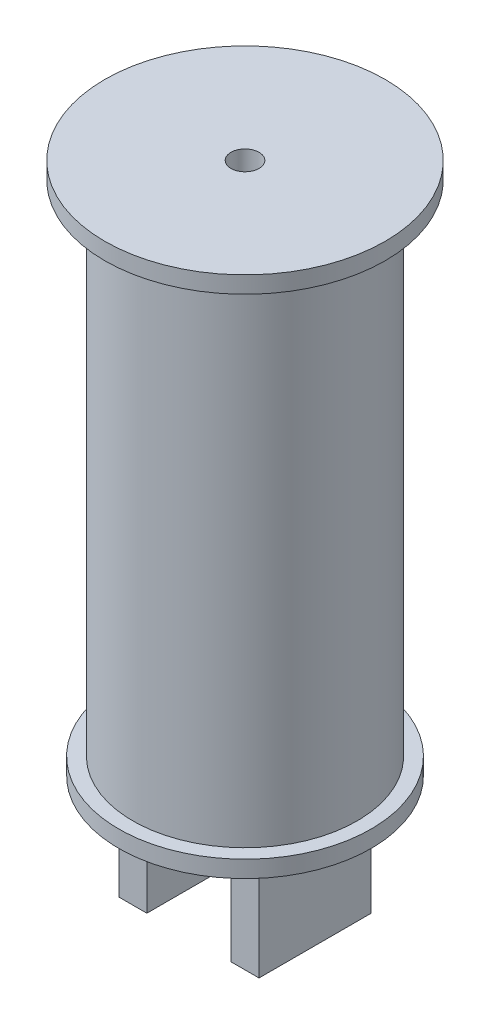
ISO-10303-21;
HEADER;
FILE_DESCRIPTION(('STEP AP214'),'2;1');
FILE_NAME('part.step','',(''),(''),'','','');
FILE_SCHEMA(('AUTOMOTIVE_DESIGN { 1 0 10303 214 1 1 1 1 }'));
ENDSEC;
DATA;
#1=APPLICATION_CONTEXT('core data for automotive mechanical design processes');
#2=APPLICATION_PROTOCOL_DEFINITION('international standard','automotive_design',2000,#1);
#3=PRODUCT_CONTEXT('',#1,'mechanical');
#4=PRODUCT('Part','Part','',(#3));
#5=PRODUCT_RELATED_PRODUCT_CATEGORY('part','',(#4));
#6=PRODUCT_DEFINITION_FORMATION('','',#4);
#7=PRODUCT_DEFINITION_CONTEXT('part definition',#1,'design');
#8=PRODUCT_DEFINITION('design','',#6,#7);
#9=PRODUCT_DEFINITION_SHAPE('','',#8);
#10=(LENGTH_UNIT() NAMED_UNIT(*) SI_UNIT(.MILLI.,.METRE.));
#11=(NAMED_UNIT(*) PLANE_ANGLE_UNIT() SI_UNIT($,.RADIAN.));
#12=(NAMED_UNIT(*) SI_UNIT($,.STERADIAN.) SOLID_ANGLE_UNIT());
#13=UNCERTAINTY_MEASURE_WITH_UNIT(LENGTH_MEASURE(1.E-05),#10,'distance_accuracy_value','');
#14=(GEOMETRIC_REPRESENTATION_CONTEXT(3) GLOBAL_UNCERTAINTY_ASSIGNED_CONTEXT((#13)) GLOBAL_UNIT_ASSIGNED_CONTEXT((#10,
#11,#12)) REPRESENTATION_CONTEXT('',''));
#15=CARTESIAN_POINT('',(0.,0.,0.));
#16=DIRECTION('',(0.,0.,1.));
#17=DIRECTION('',(1.,0.,0.));
#18=AXIS2_PLACEMENT_3D('',#15,#16,#17);
#19=CARTESIAN_POINT('',(-715.861525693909,536.876132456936,0.));
#20=DIRECTION('',(0.,1.,0.));
#21=DIRECTION('',(0.,0.,1.));
#22=AXIS2_PLACEMENT_3D('',#19,#20,#21);
#23=PLANE('',#22);
#24=CARTESIAN_POINT('',(-865.86152569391,536.876132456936,0.));
#25=DIRECTION('',(0.,-1.,0.));
#26=DIRECTION('',(0.,0.,-1.));
#27=AXIS2_PLACEMENT_3D('',#24,#25,#26);
#28=CIRCLE('',#27,300.);
#29=CARTESIAN_POINT('',(-865.86152569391,536.876132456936,-300.));
#30=VERTEX_POINT('',#29);
#31=EDGE_CURVE('E19',#30,#30,#28,.T.);
#32=ORIENTED_EDGE('',*,*,#31,.F.);
#33=EDGE_LOOP('',(#32));
#34=FACE_BOUND('',#33,.T.);
#35=ADVANCED_FACE('F16',(#34),#23,.T.);
#36=CARTESIAN_POINT('',(-865.86152569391,1886.87613245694,0.));
#37=DIRECTION('',(0.,-1.,0.));
#38=DIRECTION('',(0.,0.,-1.));
#39=AXIS2_PLACEMENT_3D('',#36,#37,#38);
#40=CYLINDRICAL_SURFACE('',#39,300.);
#41=CARTESIAN_POINT('',(-865.86152569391,1886.87613245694,0.));
#42=DIRECTION('',(0.,-1.,0.));
#43=DIRECTION('',(0.,0.,-1.));
#44=AXIS2_PLACEMENT_3D('',#41,#42,#43);
#45=CIRCLE('',#44,300.);
#46=CARTESIAN_POINT('',(-865.86152569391,1886.87613245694,-300.));
#47=VERTEX_POINT('',#46);
#48=EDGE_CURVE('E97',#47,#47,#45,.T.);
#49=ORIENTED_EDGE('',*,*,#48,.F.);
#50=EDGE_LOOP('',(#49));
#51=FACE_BOUND('',#50,.T.);
#52=ORIENTED_EDGE('',*,*,#31,.T.);
#53=EDGE_LOOP('',(#52));
#54=FACE_BOUND('',#53,.T.);
#55=ADVANCED_FACE('F135',(#51,#54),#40,.F.);
#56=CARTESIAN_POINT('',(-1065.86152569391,-213.123867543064,0.));
#57=DIRECTION('',(0.,1.,0.));
#58=DIRECTION('',(0.,0.,1.));
#59=AXIS2_PLACEMENT_3D('',#56,#57,#58);
#60=PLANE('',#59);
#61=DIRECTION('',(1.,0.,0.));
#62=VECTOR('',#61,1.);
#63=CARTESIAN_POINT('',(-1115.86152569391,-213.123867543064,200.));
#64=LINE('',#63,#62);
#65=CARTESIAN_POINT('',(-1115.86152569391,-213.123867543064,200.));
#66=VERTEX_POINT('',#65);
#67=CARTESIAN_POINT('',(-1015.86152569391,-213.123867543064,200.));
#68=VERTEX_POINT('',#67);
#69=EDGE_CURVE('E330',#66,#68,#64,.T.);
#70=ORIENTED_EDGE('',*,*,#69,.F.);
#71=DIRECTION('',(0.,0.,1.));
#72=VECTOR('',#71,1.);
#73=CARTESIAN_POINT('',(-1115.86152569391,-213.123867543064,-200.));
#74=LINE('',#73,#72);
#75=CARTESIAN_POINT('',(-1115.86152569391,-213.123867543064,-200.));
#76=VERTEX_POINT('',#75);
#77=EDGE_CURVE('E79',#76,#66,#74,.T.);
#78=ORIENTED_EDGE('',*,*,#77,.F.);
#79=DIRECTION('',(-1.,0.,0.));
#80=VECTOR('',#79,1.);
#81=CARTESIAN_POINT('',(-1015.86152569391,-213.123867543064,-200.));
#82=LINE('',#81,#80);
#83=CARTESIAN_POINT('',(-1015.86152569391,-213.123867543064,-200.));
#84=VERTEX_POINT('',#83);
#85=EDGE_CURVE('E81',#84,#76,#82,.T.);
#86=ORIENTED_EDGE('',*,*,#85,.F.);
#87=DIRECTION('',(0.,0.,1.));
#88=VECTOR('',#87,1.);
#89=CARTESIAN_POINT('',(-1015.86152569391,-213.123867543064,200.));
#90=LINE('',#89,#88);
#91=EDGE_CURVE('E84',#68,#84,#90,.F.);
#92=ORIENTED_EDGE('',*,*,#91,.F.);
#93=EDGE_LOOP('',(#70,#78,#86,#92));
#94=FACE_BOUND('',#93,.T.);
#95=ADVANCED_FACE('F83',(#94),#60,.F.);
#96=CARTESIAN_POINT('',(-665.861525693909,-213.123867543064,0.));
#97=DIRECTION('',(0.,1.,0.));
#98=DIRECTION('',(0.,0.,1.));
#99=AXIS2_PLACEMENT_3D('',#96,#97,#98);
#100=PLANE('',#99);
#101=DIRECTION('',(1.,0.,0.));
#102=VECTOR('',#101,1.);
#103=CARTESIAN_POINT('',(-715.86152569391,-213.123867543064,200.));
#104=LINE('',#103,#102);
#105=CARTESIAN_POINT('',(-715.86152569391,-213.123867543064,200.));
#106=VERTEX_POINT('',#105);
#107=CARTESIAN_POINT('',(-615.86152569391,-213.123867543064,200.));
#108=VERTEX_POINT('',#107);
#109=EDGE_CURVE('E300',#106,#108,#104,.T.);
#110=ORIENTED_EDGE('',*,*,#109,.F.);
#111=DIRECTION('',(0.,0.,1.));
#112=VECTOR('',#111,1.);
#113=CARTESIAN_POINT('',(-715.861525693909,-213.123867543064,-200.));
#114=LINE('',#113,#112);
#115=CARTESIAN_POINT('',(-715.861525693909,-213.123867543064,-200.));
#116=VERTEX_POINT('',#115);
#117=EDGE_CURVE('E301',#116,#106,#114,.T.);
#118=ORIENTED_EDGE('',*,*,#117,.F.);
#119=DIRECTION('',(-1.,0.,0.));
#120=VECTOR('',#119,1.);
#121=CARTESIAN_POINT('',(-615.86152569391,-213.123867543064,-200.));
#122=LINE('',#121,#120);
#123=CARTESIAN_POINT('',(-615.86152569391,-213.123867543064,-200.));
#124=VERTEX_POINT('',#123);
#125=EDGE_CURVE('E323',#124,#116,#122,.T.);
#126=ORIENTED_EDGE('',*,*,#125,.F.);
#127=DIRECTION('',(0.,0.,-1.));
#128=VECTOR('',#127,1.);
#129=CARTESIAN_POINT('',(-615.86152569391,-213.123867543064,200.));
#130=LINE('',#129,#128);
#131=EDGE_CURVE('E304',#108,#124,#130,.T.);
#132=ORIENTED_EDGE('',*,*,#131,.F.);
#133=EDGE_LOOP('',(#110,#118,#126,#132));
#134=FACE_BOUND('',#133,.T.);
#135=ADVANCED_FACE('F209',(#134),#100,.F.);
#136=CARTESIAN_POINT('',(-690.86152569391,1886.87613245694,0.));
#137=DIRECTION('',(0.,-1.,0.));
#138=DIRECTION('',(0.,0.,-1.));
#139=AXIS2_PLACEMENT_3D('',#136,#137,#138);
#140=PLANE('',#139);
#141=ORIENTED_EDGE('',*,*,#48,.T.);
#142=EDGE_LOOP('',(#141));
#143=FACE_BOUND('',#142,.T.);
#144=CARTESIAN_POINT('',(-865.86152569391,1886.87613245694,0.));
#145=DIRECTION('',(0.,-1.,0.));
#146=DIRECTION('',(0.,0.,-1.));
#147=AXIS2_PLACEMENT_3D('',#144,#145,#146);
#148=CIRCLE('',#147,50.0000000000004);
#149=CARTESIAN_POINT('',(-865.86152569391,1886.87613245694,-50.0000000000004));
#150=VERTEX_POINT('',#149);
#151=EDGE_CURVE('E126',#150,#150,#148,.T.);
#152=ORIENTED_EDGE('',*,*,#151,.F.);
#153=EDGE_LOOP('',(#152));
#154=FACE_BOUND('',#153,.T.);
#155=ADVANCED_FACE('F206',(#143,#154),#140,.T.);
#156=CARTESIAN_POINT('',(-1015.86152569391,186.876132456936,200.));
#157=DIRECTION('',(1.,0.,0.));
#158=DIRECTION('',(0.,1.,0.));
#159=AXIS2_PLACEMENT_3D('',#156,#157,#158);
#160=PLANE('',#159);
#161=DIRECTION('',(0.,0.,-1.));
#162=VECTOR('',#161,1.);
#163=CARTESIAN_POINT('',(-1015.86152569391,186.876132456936,0.));
#164=LINE('',#163,#162);
#165=CARTESIAN_POINT('',(-1015.86152569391,186.876132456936,200.));
#166=VERTEX_POINT('',#165);
#167=CARTESIAN_POINT('',(-1015.86152569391,186.876132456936,-200.));
#168=VERTEX_POINT('',#167);
#169=EDGE_CURVE('E128',#166,#168,#164,.T.);
#170=ORIENTED_EDGE('',*,*,#169,.F.);
#171=DIRECTION('',(0.,1.,0.));
#172=VECTOR('',#171,1.);
#173=CARTESIAN_POINT('',(-1015.86152569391,186.876132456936,200.));
#174=LINE('',#173,#172);
#175=EDGE_CURVE('E95',#68,#166,#174,.T.);
#176=ORIENTED_EDGE('',*,*,#175,.F.);
#177=ORIENTED_EDGE('',*,*,#91,.T.);
#178=DIRECTION('',(0.,1.,0.));
#179=VECTOR('',#178,1.);
#180=CARTESIAN_POINT('',(-1015.86152569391,186.876132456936,-200.));
#181=LINE('',#180,#179);
#182=EDGE_CURVE('E89',#168,#84,#181,.F.);
#183=ORIENTED_EDGE('',*,*,#182,.F.);
#184=EDGE_LOOP('',(#170,#176,#177,#183));
#185=FACE_BOUND('',#184,.T.);
#186=ADVANCED_FACE('F92',(#185),#160,.T.);
#187=CARTESIAN_POINT('',(-1015.86152569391,186.876132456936,-200.));
#188=DIRECTION('',(0.,0.,-1.));
#189=DIRECTION('',(-1.,0.,0.));
#190=AXIS2_PLACEMENT_3D('',#187,#188,#189);
#191=PLANE('',#190);
#192=DIRECTION('',(1.,0.,0.));
#193=VECTOR('',#192,1.);
#194=CARTESIAN_POINT('',(-640.86152569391,186.876132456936,-200.));
#195=LINE('',#194,#193);
#196=CARTESIAN_POINT('',(-1115.86152569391,186.876132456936,-200.));
#197=VERTEX_POINT('',#196);
#198=EDGE_CURVE('E101',#168,#197,#195,.F.);
#199=ORIENTED_EDGE('',*,*,#198,.F.);
#200=ORIENTED_EDGE('',*,*,#182,.T.);
#201=ORIENTED_EDGE('',*,*,#85,.T.);
#202=DIRECTION('',(0.,1.,0.));
#203=VECTOR('',#202,1.);
#204=CARTESIAN_POINT('',(-1115.86152569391,186.876132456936,-200.));
#205=LINE('',#204,#203);
#206=EDGE_CURVE('E104',#197,#76,#205,.F.);
#207=ORIENTED_EDGE('',*,*,#206,.F.);
#208=EDGE_LOOP('',(#199,#200,#201,#207));
#209=FACE_BOUND('',#208,.T.);
#210=ADVANCED_FACE('F99',(#209),#191,.T.);
#211=CARTESIAN_POINT('',(-1115.86152569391,186.876132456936,-200.));
#212=DIRECTION('',(-1.,0.,0.));
#213=DIRECTION('',(0.,0.,1.));
#214=AXIS2_PLACEMENT_3D('',#211,#212,#213);
#215=PLANE('',#214);
#216=DIRECTION('',(0.,0.,-1.));
#217=VECTOR('',#216,1.);
#218=CARTESIAN_POINT('',(-1115.86152569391,186.876132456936,0.));
#219=LINE('',#218,#217);
#220=CARTESIAN_POINT('',(-1115.86152569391,186.876132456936,200.));
#221=VERTEX_POINT('',#220);
#222=EDGE_CURVE('E333',#197,#221,#219,.F.);
#223=ORIENTED_EDGE('',*,*,#222,.F.);
#224=ORIENTED_EDGE('',*,*,#206,.T.);
#225=ORIENTED_EDGE('',*,*,#77,.T.);
#226=DIRECTION('',(0.,1.,0.));
#227=VECTOR('',#226,1.);
#228=CARTESIAN_POINT('',(-1115.86152569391,186.876132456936,200.));
#229=LINE('',#228,#227);
#230=EDGE_CURVE('E326',#221,#66,#229,.F.);
#231=ORIENTED_EDGE('',*,*,#230,.F.);
#232=EDGE_LOOP('',(#223,#224,#225,#231));
#233=FACE_BOUND('',#232,.T.);
#234=ADVANCED_FACE('F197',(#233),#215,.T.);
#235=CARTESIAN_POINT('',(-1115.86152569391,186.876132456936,200.));
#236=DIRECTION('',(0.,0.,1.));
#237=DIRECTION('',(1.,0.,0.));
#238=AXIS2_PLACEMENT_3D('',#235,#236,#237);
#239=PLANE('',#238);
#240=DIRECTION('',(1.,0.,0.));
#241=VECTOR('',#240,1.);
#242=CARTESIAN_POINT('',(-640.86152569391,186.876132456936,200.));
#243=LINE('',#242,#241);
#244=EDGE_CURVE('E337',#221,#166,#243,.T.);
#245=ORIENTED_EDGE('',*,*,#244,.F.);
#246=ORIENTED_EDGE('',*,*,#230,.T.);
#247=ORIENTED_EDGE('',*,*,#69,.T.);
#248=ORIENTED_EDGE('',*,*,#175,.T.);
#249=EDGE_LOOP('',(#245,#246,#247,#248));
#250=FACE_BOUND('',#249,.T.);
#251=ADVANCED_FACE('F193',(#250),#239,.T.);
#252=CARTESIAN_POINT('',(-615.86152569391,186.876132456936,200.));
#253=DIRECTION('',(1.,0.,0.));
#254=DIRECTION('',(0.,0.,-1.));
#255=AXIS2_PLACEMENT_3D('',#252,#253,#254);
#256=PLANE('',#255);
#257=DIRECTION('',(0.,0.,-1.));
#258=VECTOR('',#257,1.);
#259=CARTESIAN_POINT('',(-615.86152569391,186.876132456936,0.));
#260=LINE('',#259,#258);
#261=CARTESIAN_POINT('',(-615.86152569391,186.876132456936,200.));
#262=VERTEX_POINT('',#261);
#263=CARTESIAN_POINT('',(-615.86152569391,186.876132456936,-200.));
#264=VERTEX_POINT('',#263);
#265=EDGE_CURVE('E341',#262,#264,#260,.T.);
#266=ORIENTED_EDGE('',*,*,#265,.F.);
#267=DIRECTION('',(0.,1.,0.));
#268=VECTOR('',#267,1.);
#269=CARTESIAN_POINT('',(-615.86152569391,186.876132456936,200.));
#270=LINE('',#269,#268);
#271=EDGE_CURVE('E307',#108,#262,#270,.T.);
#272=ORIENTED_EDGE('',*,*,#271,.F.);
#273=ORIENTED_EDGE('',*,*,#131,.T.);
#274=DIRECTION('',(0.,1.,0.));
#275=VECTOR('',#274,1.);
#276=CARTESIAN_POINT('',(-615.86152569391,186.876132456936,-200.));
#277=LINE('',#276,#275);
#278=EDGE_CURVE('E311',#264,#124,#277,.F.);
#279=ORIENTED_EDGE('',*,*,#278,.F.);
#280=EDGE_LOOP('',(#266,#272,#273,#279));
#281=FACE_BOUND('',#280,.T.);
#282=ADVANCED_FACE('F189',(#281),#256,.T.);
#283=CARTESIAN_POINT('',(-615.86152569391,186.876132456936,-200.));
#284=DIRECTION('',(0.,0.,-1.));
#285=DIRECTION('',(-1.,0.,0.));
#286=AXIS2_PLACEMENT_3D('',#283,#284,#285);
#287=PLANE('',#286);
#288=DIRECTION('',(1.,0.,0.));
#289=VECTOR('',#288,1.);
#290=CARTESIAN_POINT('',(-640.86152569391,186.876132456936,-200.));
#291=LINE('',#290,#289);
#292=CARTESIAN_POINT('',(-715.861525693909,186.876132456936,-200.));
#293=VERTEX_POINT('',#292);
#294=EDGE_CURVE('E344',#264,#293,#291,.F.);
#295=ORIENTED_EDGE('',*,*,#294,.F.);
#296=ORIENTED_EDGE('',*,*,#278,.T.);
#297=ORIENTED_EDGE('',*,*,#125,.T.);
#298=DIRECTION('',(0.,1.,0.));
#299=VECTOR('',#298,1.);
#300=CARTESIAN_POINT('',(-715.861525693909,186.876132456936,-200.));
#301=LINE('',#300,#299);
#302=EDGE_CURVE('E308',#293,#116,#301,.F.);
#303=ORIENTED_EDGE('',*,*,#302,.F.);
#304=EDGE_LOOP('',(#295,#296,#297,#303));
#305=FACE_BOUND('',#304,.T.);
#306=ADVANCED_FACE('F186',(#305),#287,.T.);
#307=CARTESIAN_POINT('',(-715.861525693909,186.876132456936,-200.));
#308=DIRECTION('',(-1.,0.,0.));
#309=DIRECTION('',(0.,0.,1.));
#310=AXIS2_PLACEMENT_3D('',#307,#308,#309);
#311=PLANE('',#310);
#312=DIRECTION('',(0.,0.,-1.));
#313=VECTOR('',#312,1.);
#314=CARTESIAN_POINT('',(-715.861525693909,186.876132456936,0.));
#315=LINE('',#314,#313);
#316=CARTESIAN_POINT('',(-715.86152569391,186.876132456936,200.));
#317=VERTEX_POINT('',#316);
#318=EDGE_CURVE('E347',#293,#317,#315,.F.);
#319=ORIENTED_EDGE('',*,*,#318,.F.);
#320=ORIENTED_EDGE('',*,*,#302,.T.);
#321=ORIENTED_EDGE('',*,*,#117,.T.);
#322=DIRECTION('',(0.,1.,0.));
#323=VECTOR('',#322,1.);
#324=CARTESIAN_POINT('',(-715.86152569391,186.876132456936,200.));
#325=LINE('',#324,#323);
#326=EDGE_CURVE('E34',#317,#106,#325,.F.);
#327=ORIENTED_EDGE('',*,*,#326,.F.);
#328=EDGE_LOOP('',(#319,#320,#321,#327));
#329=FACE_BOUND('',#328,.T.);
#330=ADVANCED_FACE('F182',(#329),#311,.T.);
#331=CARTESIAN_POINT('',(-715.86152569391,186.876132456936,200.));
#332=DIRECTION('',(0.,0.,1.));
#333=DIRECTION('',(1.,0.,0.));
#334=AXIS2_PLACEMENT_3D('',#331,#332,#333);
#335=PLANE('',#334);
#336=DIRECTION('',(1.,0.,0.));
#337=VECTOR('',#336,1.);
#338=CARTESIAN_POINT('',(-640.86152569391,186.876132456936,200.));
#339=LINE('',#338,#337);
#340=EDGE_CURVE('E125',#317,#262,#339,.T.);
#341=ORIENTED_EDGE('',*,*,#340,.F.);
#342=ORIENTED_EDGE('',*,*,#326,.T.);
#343=ORIENTED_EDGE('',*,*,#109,.T.);
#344=ORIENTED_EDGE('',*,*,#271,.T.);
#345=EDGE_LOOP('',(#341,#342,#343,#344));
#346=FACE_BOUND('',#345,.T.);
#347=ADVANCED_FACE('F178',(#346),#335,.T.);
#348=CARTESIAN_POINT('',(-865.86152569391,2086.87613245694,0.));
#349=DIRECTION('',(0.,-1.,0.));
#350=DIRECTION('',(0.,0.,-1.));
#351=AXIS2_PLACEMENT_3D('',#348,#349,#350);
#352=CYLINDRICAL_SURFACE('',#351,50.0000000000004);
#353=CARTESIAN_POINT('',(-865.86152569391,2086.87613245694,0.));
#354=DIRECTION('',(0.,-1.,0.));
#355=DIRECTION('',(0.,0.,-1.));
#356=AXIS2_PLACEMENT_3D('',#353,#354,#355);
#357=CIRCLE('',#356,50.0000000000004);
#358=CARTESIAN_POINT('',(-865.86152569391,2086.87613245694,-50.0000000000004));
#359=VERTEX_POINT('',#358);
#360=EDGE_CURVE('E122',#359,#359,#357,.T.);
#361=ORIENTED_EDGE('',*,*,#360,.F.);
#362=EDGE_LOOP('',(#361));
#363=FACE_BOUND('',#362,.T.);
#364=ORIENTED_EDGE('',*,*,#151,.T.);
#365=EDGE_LOOP('',(#364));
#366=FACE_BOUND('',#365,.T.);
#367=ADVANCED_FACE('F174',(#363,#366),#352,.F.);
#368=CARTESIAN_POINT('',(-640.86152569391,186.876132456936,0.));
#369=DIRECTION('',(0.,-1.,0.));
#370=DIRECTION('',(0.,0.,-1.));
#371=AXIS2_PLACEMENT_3D('',#368,#369,#370);
#372=PLANE('',#371);
#373=CARTESIAN_POINT('',(-865.86152569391,186.876132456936,0.));
#374=DIRECTION('',(0.,-1.,0.));
#375=DIRECTION('',(0.,0.,-1.));
#376=AXIS2_PLACEMENT_3D('',#373,#374,#375);
#377=CIRCLE('',#376,450.);
#378=CARTESIAN_POINT('',(-865.86152569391,186.876132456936,-450.));
#379=VERTEX_POINT('',#378);
#380=EDGE_CURVE('E119',#379,#379,#377,.F.);
#381=ORIENTED_EDGE('',*,*,#380,.F.);
#382=EDGE_LOOP('',(#381));
#383=FACE_BOUND('',#382,.T.);
#384=ORIENTED_EDGE('',*,*,#318,.T.);
#385=ORIENTED_EDGE('',*,*,#340,.T.);
#386=ORIENTED_EDGE('',*,*,#265,.T.);
#387=ORIENTED_EDGE('',*,*,#294,.T.);
#388=EDGE_LOOP('',(#384,#385,#386,#387));
#389=FACE_BOUND('',#388,.T.);
#390=ORIENTED_EDGE('',*,*,#222,.T.);
#391=ORIENTED_EDGE('',*,*,#244,.T.);
#392=ORIENTED_EDGE('',*,*,#169,.T.);
#393=ORIENTED_EDGE('',*,*,#198,.T.);
#394=EDGE_LOOP('',(#390,#391,#392,#393));
#395=FACE_BOUND('',#394,.T.);
#396=ADVANCED_FACE('F170',(#383,#389,#395),#372,.T.);
#397=CARTESIAN_POINT('',(-590.86152569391,2086.87613245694,0.));
#398=DIRECTION('',(0.,1.,0.));
#399=DIRECTION('',(0.,0.,1.));
#400=AXIS2_PLACEMENT_3D('',#397,#398,#399);
#401=PLANE('',#400);
#402=ORIENTED_EDGE('',*,*,#360,.T.);
#403=EDGE_LOOP('',(#402));
#404=FACE_BOUND('',#403,.T.);
#405=CARTESIAN_POINT('',(-865.86152569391,2086.87613245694,0.));
#406=DIRECTION('',(0.,-1.,0.));
#407=DIRECTION('',(0.,0.,-1.));
#408=AXIS2_PLACEMENT_3D('',#405,#406,#407);
#409=CIRCLE('',#408,500.);
#410=CARTESIAN_POINT('',(-865.86152569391,2086.87613245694,-500.));
#411=VERTEX_POINT('',#410);
#412=EDGE_CURVE('E116',#411,#411,#409,.T.);
#413=ORIENTED_EDGE('',*,*,#412,.F.);
#414=EDGE_LOOP('',(#413));
#415=FACE_BOUND('',#414,.T.);
#416=ADVANCED_FACE('F166',(#404,#415),#401,.T.);
#417=CARTESIAN_POINT('',(-865.86152569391,216.876132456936,0.));
#418=DIRECTION('',(0.,-1.,0.));
#419=DIRECTION('',(0.,0.,-1.));
#420=AXIS2_PLACEMENT_3D('',#417,#418,#419);
#421=CYLINDRICAL_SURFACE('',#420,450.);
#422=ORIENTED_EDGE('',*,*,#380,.T.);
#423=EDGE_LOOP('',(#422));
#424=FACE_BOUND('',#423,.T.);
#425=CARTESIAN_POINT('',(-865.86152569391,246.876132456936,0.));
#426=DIRECTION('',(0.,-1.,0.));
#427=DIRECTION('',(0.,0.,-1.));
#428=AXIS2_PLACEMENT_3D('',#425,#426,#427);
#429=CIRCLE('',#428,450.);
#430=CARTESIAN_POINT('',(-865.86152569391,246.876132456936,-450.));
#431=VERTEX_POINT('',#430);
#432=EDGE_CURVE('E113',#431,#431,#429,.F.);
#433=ORIENTED_EDGE('',*,*,#432,.F.);
#434=EDGE_LOOP('',(#433));
#435=FACE_BOUND('',#434,.T.);
#436=ADVANCED_FACE('F162',(#424,#435),#421,.T.);
#437=CARTESIAN_POINT('',(-865.86152569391,2056.87613245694,0.));
#438=DIRECTION('',(0.,-1.,0.));
#439=DIRECTION('',(0.,0.,-1.));
#440=AXIS2_PLACEMENT_3D('',#437,#438,#439);
#441=CYLINDRICAL_SURFACE('',#440,500.);
#442=CARTESIAN_POINT('',(-865.86152569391,2026.87613245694,0.));
#443=DIRECTION('',(0.,-1.,0.));
#444=DIRECTION('',(0.,0.,-1.));
#445=AXIS2_PLACEMENT_3D('',#442,#443,#444);
#446=CIRCLE('',#445,500.);
#447=CARTESIAN_POINT('',(-865.86152569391,2026.87613245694,-500.));
#448=VERTEX_POINT('',#447);
#449=EDGE_CURVE('E110',#448,#448,#446,.T.);
#450=ORIENTED_EDGE('',*,*,#449,.F.);
#451=EDGE_LOOP('',(#450));
#452=FACE_BOUND('',#451,.T.);
#453=ORIENTED_EDGE('',*,*,#412,.T.);
#454=EDGE_LOOP('',(#453));
#455=FACE_BOUND('',#454,.T.);
#456=ADVANCED_FACE('F158',(#452,#455),#441,.T.);
#457=CARTESIAN_POINT('',(-440.86152569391,246.876132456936,0.));
#458=DIRECTION('',(0.,1.,0.));
#459=DIRECTION('',(0.,0.,1.));
#460=AXIS2_PLACEMENT_3D('',#457,#458,#459);
#461=PLANE('',#460);
#462=CARTESIAN_POINT('',(-865.86152569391,246.876132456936,0.));
#463=DIRECTION('',(0.,-1.,0.));
#464=DIRECTION('',(0.,0.,-1.));
#465=AXIS2_PLACEMENT_3D('',#462,#463,#464);
#466=CIRCLE('',#465,400.);
#467=CARTESIAN_POINT('',(-865.86152569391,246.876132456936,-400.));
#468=VERTEX_POINT('',#467);
#469=EDGE_CURVE('E25',#468,#468,#466,.F.);
#470=ORIENTED_EDGE('',*,*,#469,.F.);
#471=EDGE_LOOP('',(#470));
#472=FACE_BOUND('',#471,.T.);
#473=ORIENTED_EDGE('',*,*,#432,.T.);
#474=EDGE_LOOP('',(#473));
#475=FACE_BOUND('',#474,.T.);
#476=ADVANCED_FACE('F151',(#472,#475),#461,.T.);
#477=CARTESIAN_POINT('',(-415.86152569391,2026.87613245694,0.));
#478=DIRECTION('',(0.,-1.,0.));
#479=DIRECTION('',(0.,0.,-1.));
#480=AXIS2_PLACEMENT_3D('',#477,#478,#479);
#481=PLANE('',#480);
#482=ORIENTED_EDGE('',*,*,#449,.T.);
#483=EDGE_LOOP('',(#482));
#484=FACE_BOUND('',#483,.T.);
#485=CARTESIAN_POINT('',(-865.86152569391,2026.87613245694,0.));
#486=DIRECTION('',(0.,-1.,0.));
#487=DIRECTION('',(0.,0.,-1.));
#488=AXIS2_PLACEMENT_3D('',#485,#486,#487);
#489=CIRCLE('',#488,400.);
#490=CARTESIAN_POINT('',(-865.86152569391,2026.87613245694,-400.));
#491=VERTEX_POINT('',#490);
#492=EDGE_CURVE('E10',#491,#491,#489,.T.);
#493=ORIENTED_EDGE('',*,*,#492,.F.);
#494=EDGE_LOOP('',(#493));
#495=FACE_BOUND('',#494,.T.);
#496=ADVANCED_FACE('F145',(#484,#495),#481,.T.);
#497=CARTESIAN_POINT('',(-865.86152569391,1136.87613245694,0.));
#498=DIRECTION('',(0.,-1.,0.));
#499=DIRECTION('',(0.,0.,-1.));
#500=AXIS2_PLACEMENT_3D('',#497,#498,#499);
#501=CYLINDRICAL_SURFACE('',#500,400.);
#502=ORIENTED_EDGE('',*,*,#469,.T.);
#503=EDGE_LOOP('',(#502));
#504=FACE_BOUND('',#503,.T.);
#505=ORIENTED_EDGE('',*,*,#492,.T.);
#506=EDGE_LOOP('',(#505));
#507=FACE_BOUND('',#506,.T.);
#508=ADVANCED_FACE('F143',(#504,#507),#501,.T.);
#509=CLOSED_SHELL('',(#35,#55,#95,#135,#155,#186,#210,#234,#251,#282,#306,#330,#347,#367,#396,
#416,#436,#456,#476,#496,#508));
#510=MANIFOLD_SOLID_BREP('B1',#509);
#511=ADVANCED_BREP_SHAPE_REPRESENTATION('',(#18,#510),#14);
#512=SHAPE_DEFINITION_REPRESENTATION(#9,#511);
ENDSEC;
END-ISO-10303-21;
